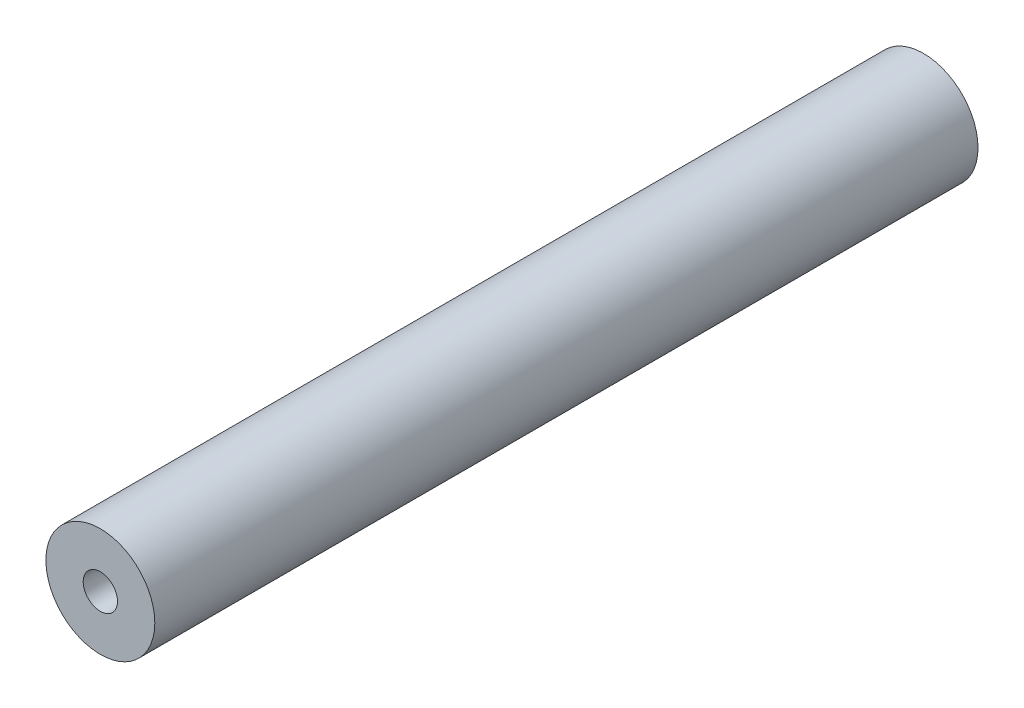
from build123d import *

# Parameters (mm, degrees)
SKETCH1_R                 = 3.96875
BOSS_EXTRUDE1_DEPTH       = 30
M3X0_5_TAPPED_HOLE1_D     = 2.5
M3X0_5_TAPPED_HOLE1_DEPTH = 7.50062
M3X0_5_TAPPED_HOLE1_TIP   = 0.751075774
M3X0_5_TAPPED_HOLE2_D     = 2.5
M3X0_5_TAPPED_HOLE2_DEPTH = 7.50062
M3X0_5_TAPPED_HOLE2_TIP   = 0.751075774


with BuildPart() as part:
    # Sketch1 → Boss-Extrude1 (new, symmetric)
    with BuildSketch(Plane.XY):
        Circle(SKETCH1_R)
    extrude(amount=BOSS_EXTRUDE1_DEPTH, both=True)

    # M3x0.5 Tapped Hole1
    with Locations(Plane.XY.offset(30)):
        with Locations((0, 0)):
            Hole(M3X0_5_TAPPED_HOLE1_D / 2, depth=M3X0_5_TAPPED_HOLE1_DEPTH)
            with Locations((0, 0, -(M3X0_5_TAPPED_HOLE1_DEPTH + M3X0_5_TAPPED_HOLE1_TIP / 2))):  # 118° drill point
                Cone(0, M3X0_5_TAPPED_HOLE1_D / 2, M3X0_5_TAPPED_HOLE1_TIP, mode=Mode.SUBTRACT)

    # M3x0.5 Tapped Hole2
    with Locations(Plane(origin=(0, 0, -30), x_dir=(-1, 0, 0), z_dir=(0, 0, -1))):
        with Locations((0, 0)):
            Hole(M3X0_5_TAPPED_HOLE2_D / 2, depth=M3X0_5_TAPPED_HOLE2_DEPTH)
            with Locations((0, 0, -(M3X0_5_TAPPED_HOLE2_DEPTH + M3X0_5_TAPPED_HOLE2_TIP / 2))):  # 118° drill point
                Cone(0, M3X0_5_TAPPED_HOLE2_D / 2, M3X0_5_TAPPED_HOLE2_TIP, mode=Mode.SUBTRACT)


solid = part.part
